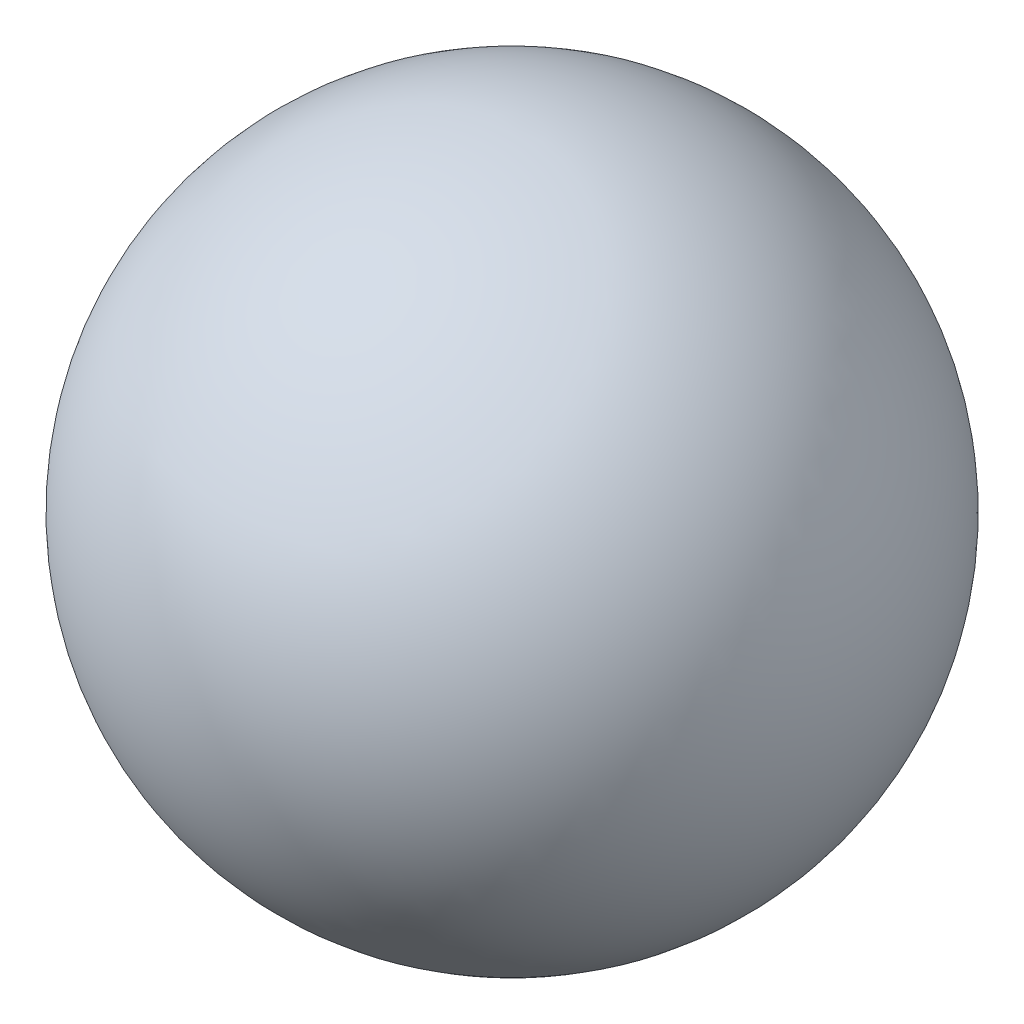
from build123d import *

# Parameters (mm, degrees)
DIAM_TRE_DU_PER_AGE_M10_0_10_000000_1_D     = 10
DIAM_TRE_DU_PER_AGE_M10_0_10_000000_1_DEPTH = 16
DIAM_TRE_DU_PER_AGE_M10_0_10_000000_1_TIP   = 3.004303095


with BuildPart() as part:
    # Esquisse1 → R_volution1 (revolve)
    with BuildSketch(Plane(origin=(0, 0, 0), x_dir=(1, 0, 0), z_dir=(0, 1, 0))):
        with BuildLine():
            Line((0, 10), (0, -10))
            ThreePointArc((0, -10), (10, 0), (0, 10))
        make_face()
    revolve(axis=Axis((0, 0, -28.212699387), (0, 0, 1)))

    # Diam_tre du per_age M10.0 _10.000000_1
    with Locations(Plane(origin=(-0.004426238, -9.99999902, 0), x_dir=(-0.999999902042, 0.000442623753, 0), z_dir=(-0.000442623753, -0.999999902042, 0))):
        with Locations((0, 0)):
            Hole(DIAM_TRE_DU_PER_AGE_M10_0_10_000000_1_D / 2, depth=DIAM_TRE_DU_PER_AGE_M10_0_10_000000_1_DEPTH)
            with Locations((0, 0, -(DIAM_TRE_DU_PER_AGE_M10_0_10_000000_1_DEPTH + DIAM_TRE_DU_PER_AGE_M10_0_10_000000_1_TIP / 2))):  # 118° drill point
                Cone(0, DIAM_TRE_DU_PER_AGE_M10_0_10_000000_1_D / 2, DIAM_TRE_DU_PER_AGE_M10_0_10_000000_1_TIP, mode=Mode.SUBTRACT)


solid = part.part
